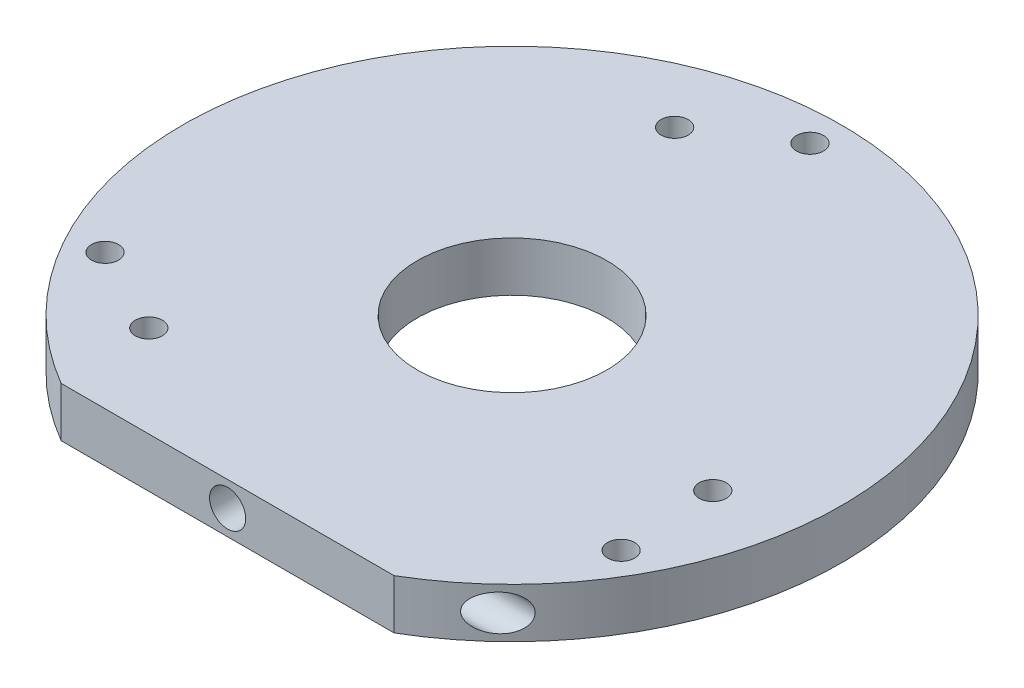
ISO-10303-21;
HEADER;
FILE_DESCRIPTION(('STEP AP214'),'2;1');
FILE_NAME('part.step','',(''),(''),'','','');
FILE_SCHEMA(('AUTOMOTIVE_DESIGN { 1 0 10303 214 1 1 1 1 }'));
ENDSEC;
DATA;
#1=APPLICATION_CONTEXT('core data for automotive mechanical design processes');
#2=APPLICATION_PROTOCOL_DEFINITION('international standard','automotive_design',2000,#1);
#3=PRODUCT_CONTEXT('',#1,'mechanical');
#4=PRODUCT('Part','Part','',(#3));
#5=PRODUCT_RELATED_PRODUCT_CATEGORY('part','',(#4));
#6=PRODUCT_DEFINITION_FORMATION('','',#4);
#7=PRODUCT_DEFINITION_CONTEXT('part definition',#1,'design');
#8=PRODUCT_DEFINITION('design','',#6,#7);
#9=PRODUCT_DEFINITION_SHAPE('','',#8);
#10=(LENGTH_UNIT() NAMED_UNIT(*) SI_UNIT(.MILLI.,.METRE.));
#11=(NAMED_UNIT(*) PLANE_ANGLE_UNIT() SI_UNIT($,.RADIAN.));
#12=(NAMED_UNIT(*) SI_UNIT($,.STERADIAN.) SOLID_ANGLE_UNIT());
#13=UNCERTAINTY_MEASURE_WITH_UNIT(LENGTH_MEASURE(1.E-05),#10,'distance_accuracy_value','');
#14=(GEOMETRIC_REPRESENTATION_CONTEXT(3) GLOBAL_UNCERTAINTY_ASSIGNED_CONTEXT((#13)) GLOBAL_UNIT_ASSIGNED_CONTEXT((#10,
#11,#12)) REPRESENTATION_CONTEXT('',''));
#15=CARTESIAN_POINT('',(0.,0.,0.));
#16=DIRECTION('',(0.,0.,1.));
#17=DIRECTION('',(1.,0.,0.));
#18=AXIS2_PLACEMENT_3D('',#15,#16,#17);
#19=CARTESIAN_POINT('',(36.501,-4.74999999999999,26.5));
#20=DIRECTION('',(-1.,0.,0.));
#21=DIRECTION('',(0.,0.,1.));
#22=AXIS2_PLACEMENT_3D('',#19,#20,#21);
#23=CYLINDRICAL_SURFACE('',#22,2.);
#24=CARTESIAN_POINT('',(22.8035085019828,-4.74999999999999,28.5));
#25=CARTESIAN_POINT('',(22.8035194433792,-4.66614474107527,28.4999917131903));
#26=CARTESIAN_POINT('',(22.8101869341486,-4.58214146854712,28.4946603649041));
#27=CARTESIAN_POINT('',(22.836100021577,-4.41730327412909,28.4738966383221));
#28=CARTESIAN_POINT('',(22.8553814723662,-4.33647808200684,28.4584354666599));
#29=CARTESIAN_POINT('',(22.9042916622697,-4.1812608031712,28.4190848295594));
#30=CARTESIAN_POINT('',(22.9338120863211,-4.10681116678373,28.3952835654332));
#31=CARTESIAN_POINT('',(23.0010219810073,-3.96449597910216,28.3408690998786));
#32=CARTESIAN_POINT('',(23.0387126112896,-3.89663136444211,28.3102549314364));
#33=CARTESIAN_POINT('',(23.1425383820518,-3.73255945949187,28.2255110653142));
#34=CARTESIAN_POINT('',(23.2129906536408,-3.64102699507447,28.1676508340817));
#35=CARTESIAN_POINT('',(23.3634974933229,-3.47316212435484,28.0429420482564));
#36=CARTESIAN_POINT('',(23.443578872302,-3.3968738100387,27.9760683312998));
#37=CARTESIAN_POINT('',(23.5892914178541,-3.27545746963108,27.8532234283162));
#38=CARTESIAN_POINT('',(23.6536059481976,-3.22728716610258,27.798639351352));
#39=CARTESIAN_POINT('',(23.784763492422,-3.13837657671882,27.6865037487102));
#40=CARTESIAN_POINT('',(23.8516077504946,-3.09764000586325,27.6289507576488));
#41=CARTESIAN_POINT('',(24.0548205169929,-2.98595285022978,27.4526435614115));
#42=CARTESIAN_POINT('',(24.1938826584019,-2.92551392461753,27.3302296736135));
#43=CARTESIAN_POINT('',(24.4802446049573,-2.82909849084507,27.0740844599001));
#44=CARTESIAN_POINT('',(24.627655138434,-2.79415684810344,26.9400986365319));
#45=CARTESIAN_POINT('',(24.9223768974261,-2.75228770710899,26.6676836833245));
#46=CARTESIAN_POINT('',(25.0696881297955,-2.74535802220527,26.5292549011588));
#47=CARTESIAN_POINT('',(25.3613275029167,-2.76070477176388,26.2505960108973));
#48=CARTESIAN_POINT('',(25.5056535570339,-2.78300097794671,26.1103647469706));
#49=CARTESIAN_POINT('',(25.7877267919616,-2.85940936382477,25.8318062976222));
#50=CARTESIAN_POINT('',(25.9254811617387,-2.91348587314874,25.6934771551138));
#51=CARTESIAN_POINT('',(26.1515970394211,-3.03641799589,25.462956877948));
#52=CARTESIAN_POINT('',(26.2427926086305,-3.09658550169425,25.3689125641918));
#53=CARTESIAN_POINT('',(26.4167638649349,-3.23641911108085,25.1877003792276));
#54=CARTESIAN_POINT('',(26.4995516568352,-3.31605660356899,25.1005226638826));
#55=CARTESIAN_POINT('',(26.6355340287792,-3.47522142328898,24.9560782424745));
#56=CARTESIAN_POINT('',(26.6911622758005,-3.55059027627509,24.8965356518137));
#57=CARTESIAN_POINT('',(26.7931403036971,-3.71346703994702,24.7867550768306));
#58=CARTESIAN_POINT('',(26.8395013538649,-3.80095998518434,24.7365057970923));
#59=CARTESIAN_POINT('',(26.9134018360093,-3.9708233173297,24.656059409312));
#60=CARTESIAN_POINT('',(26.9428120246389,-4.05144151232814,24.6238951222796));
#61=CARTESIAN_POINT('',(26.9921293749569,-4.21882955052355,24.5698249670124));
#62=CARTESIAN_POINT('',(27.0120416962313,-4.30559602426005,24.5479135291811));
#63=CARTESIAN_POINT('',(27.0412231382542,-4.48350719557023,24.5157651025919));
#64=CARTESIAN_POINT('',(27.0504384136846,-4.57467165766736,24.5055871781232));
#65=CARTESIAN_POINT('',(27.057386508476,-4.75796714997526,24.4979155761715));
#66=CARTESIAN_POINT('',(27.055122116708,-4.85009793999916,24.5004188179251));
#67=CARTESIAN_POINT('',(27.0399634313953,-5.02443145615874,24.5171466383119));
#68=CARTESIAN_POINT('',(27.0279828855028,-5.10681559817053,24.5303636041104));
#69=CARTESIAN_POINT('',(26.9952458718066,-5.26761622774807,24.5663853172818));
#70=CARTESIAN_POINT('',(26.9744886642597,-5.34603238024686,24.5891908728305));
#71=CARTESIAN_POINT('',(26.9241028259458,-5.50074948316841,24.6443529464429));
#72=CARTESIAN_POINT('',(26.8941150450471,-5.57679386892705,24.6770951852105));
#73=CARTESIAN_POINT('',(26.8269802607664,-5.72176054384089,24.7500625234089));
#74=CARTESIAN_POINT('',(26.7898292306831,-5.79067879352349,24.7902918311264));
#75=CARTESIAN_POINT('',(26.6904944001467,-5.95192247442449,24.8972894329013));
#76=CARTESIAN_POINT('',(26.6248128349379,-6.03977326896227,24.9675749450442));
#77=CARTESIAN_POINT('',(26.483957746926,-6.1988282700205,25.116938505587));
#78=CARTESIAN_POINT('',(26.4087637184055,-6.26999553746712,25.1960355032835));
#79=CARTESIAN_POINT('',(26.2230230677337,-6.41932603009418,25.3895022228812));
#80=CARTESIAN_POINT('',(26.1095309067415,-6.49069954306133,25.5062773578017));
#81=CARTESIAN_POINT('',(25.8744931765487,-6.60664263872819,25.7446859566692));
#82=CARTESIAN_POINT('',(25.7529376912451,-6.65117851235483,25.8663253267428));
#83=CARTESIAN_POINT('',(25.4683772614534,-6.72538219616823,26.1469362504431));
#84=CARTESIAN_POINT('',(25.3036716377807,-6.74685849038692,26.3063937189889));
#85=CARTESIAN_POINT('',(25.054260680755,-6.75109382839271,26.5433116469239));
#86=CARTESIAN_POINT('',(24.9706118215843,-6.74781793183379,26.6220157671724));
#87=CARTESIAN_POINT('',(24.8030436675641,-6.73210996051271,26.7782016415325));
#88=CARTESIAN_POINT('',(24.7191245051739,-6.71968184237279,26.8556839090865));
#89=CARTESIAN_POINT('',(24.5506433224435,-6.68556392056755,27.0097965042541));
#90=CARTESIAN_POINT('',(24.4660845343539,-6.66377263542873,27.0864077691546));
#91=CARTESIAN_POINT('',(24.2978650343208,-6.61081415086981,27.2374104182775));
#92=CARTESIAN_POINT('',(24.2142045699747,-6.57964443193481,27.3118012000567));
#93=CARTESIAN_POINT('',(24.0487721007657,-6.50773501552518,27.4575796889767));
#94=CARTESIAN_POINT('',(23.9669959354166,-6.46701918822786,27.5289743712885));
#95=CARTESIAN_POINT('',(23.8061573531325,-6.37551184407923,27.6681797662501));
#96=CARTESIAN_POINT('',(23.7270928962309,-6.32472810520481,27.7359931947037));
#97=CARTESIAN_POINT('',(23.5660096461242,-6.20728499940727,27.8730216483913));
#98=CARTESIAN_POINT('',(23.4843634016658,-6.13960936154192,27.9418154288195));
#99=CARTESIAN_POINT('',(23.3284027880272,-5.99021576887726,28.0721553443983));
#100=CARTESIAN_POINT('',(23.2540791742,-5.90851588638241,28.1337106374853));
#101=CARTESIAN_POINT('',(23.1324306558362,-5.7503510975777,28.2337631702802));
#102=CARTESIAN_POINT('',(23.0828195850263,-5.67696692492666,28.2743134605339));
#103=CARTESIAN_POINT('',(22.9929649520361,-5.52096081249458,28.3474321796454));
#104=CARTESIAN_POINT('',(22.9527095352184,-5.43835076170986,28.3800107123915));
#105=CARTESIAN_POINT('',(22.8923772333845,-5.28403428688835,28.4286867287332));
#106=CARTESIAN_POINT('',(22.8698066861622,-5.21395637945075,28.4468356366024));
#107=CARTESIAN_POINT('',(22.8340060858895,-5.07003923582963,28.4755808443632));
#108=CARTESIAN_POINT('',(22.8207512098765,-4.99621056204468,28.4861972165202));
#109=CARTESIAN_POINT('',(22.8096595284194,-4.89312844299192,28.4950775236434));
#110=CARTESIAN_POINT('',(22.807358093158,-4.86459020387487,28.4969195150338));
#111=CARTESIAN_POINT('',(22.8042805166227,-4.80737377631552,28.4993823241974));
#112=CARTESIAN_POINT('',(22.8035047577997,-4.77869555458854,28.5000028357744));
#113=CARTESIAN_POINT('',(22.8035085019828,-4.74999999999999,28.5));
#114=B_SPLINE_CURVE_WITH_KNOTS('',3,(#24,#25,#26,#27,#28,#29,#30,#31,#32,#33,#34,#35,#36,#37,
#38,#39,#40,#41,#42,#43,#44,#45,#46,#47,#48,#49,#50,#51,#52,#53,#54,#55,#56,#57,#58,#59,#60,#61,
#62,#63,#64,#65,#66,#67,#68,#69,#70,#71,#72,#73,#74,#75,#76,#77,#78,#79,#80,#81,#82,#83,#84,#85,
#86,#87,#88,#89,#90,#91,#92,#93,#94,#95,#96,#97,#98,#99,#100,#101,#102,#103,#104,#105,#106,#107,
#108,#109,#110,#111,#112,#113),.UNSPECIFIED.,.T.,.F.,(4,2,2,2,2,2,2,2,2,2,2,2,2,2,2,2,2,2,2,2,2,
2,2,2,2,2,2,2,2,2,2,2,2,2,2,2,2,2,2,2,2,2,2,2,4),(0.,0.251419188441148,0.503556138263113,
0.753103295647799,1.0026858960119,1.3880944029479,1.77460201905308,2.06563988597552,
2.35682280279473,2.93912672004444,3.54391885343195,4.14866377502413,4.75381802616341,
5.35829434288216,5.78938786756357,6.21985166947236,6.55165131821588,6.88304499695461,
7.15684714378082,7.43050038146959,7.7055252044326,7.98048321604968,8.23222343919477,
8.48398488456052,8.74714645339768,9.01045638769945,9.39910954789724,9.78861526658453,
10.3190888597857,10.850227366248,11.537142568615,11.881574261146,12.2258571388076,
12.573969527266,12.922175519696,13.2695199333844,13.6165970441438,13.9948499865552,
14.3726191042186,14.6639364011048,14.9548825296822,15.1814902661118,15.4074918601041,
15.4935068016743,15.5795433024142),.UNSPECIFIED.);
#115=CARTESIAN_POINT('',(22.8035085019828,-4.74999999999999,28.5));
#116=VERTEX_POINT('',#115);
#117=EDGE_CURVE('E103',#116,#116,#114,.T.);
#118=ORIENTED_EDGE('',*,*,#117,.F.);
#119=EDGE_LOOP('',(#118));
#120=FACE_BOUND('',#119,.T.);
#121=CARTESIAN_POINT('',(0.000911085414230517,-4.75,26.5));
#122=DIRECTION('',(-0.707106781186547,0.,-0.707106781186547));
#123=DIRECTION('',(-0.707106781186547,0.,0.707106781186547));
#124=AXIS2_PLACEMENT_3D('',#121,#122,#123);
#125=ELLIPSE('',#124,2.82842712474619,2.);
#126=CARTESIAN_POINT('',(0.000911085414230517,-2.75,26.5));
#127=VERTEX_POINT('',#126);
#128=CARTESIAN_POINT('',(0.000911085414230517,-6.75,26.5));
#129=VERTEX_POINT('',#128);
#130=EDGE_CURVE('E98',#127,#129,#125,.T.);
#131=ORIENTED_EDGE('',*,*,#130,.T.);
#132=CARTESIAN_POINT('',(0.000911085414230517,-4.75,26.5));
#133=DIRECTION('',(-0.707106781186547,0.,0.707106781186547));
#134=DIRECTION('',(-0.707106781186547,0.,-0.707106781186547));
#135=AXIS2_PLACEMENT_3D('',#132,#133,#134);
#136=ELLIPSE('',#135,2.82842712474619,2.);
#137=EDGE_CURVE('E96',#129,#127,#136,.T.);
#138=ORIENTED_EDGE('',*,*,#137,.T.);
#139=EDGE_LOOP('',(#131,#138));
#140=FACE_BOUND('',#139,.T.);
#141=ADVANCED_FACE('F44',(#120,#140),#23,.F.);
#142=CARTESIAN_POINT('',(0.,37.9568335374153,0.));
#143=DIRECTION('',(0.,1.,0.));
#144=DIRECTION('',(0.,0.,1.));
#145=AXIS2_PLACEMENT_3D('',#142,#143,#144);
#146=CYLINDRICAL_SURFACE('',#145,36.5);
#147=CARTESIAN_POINT('',(0.,-1.99999999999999,0.));
#148=DIRECTION('',(0.,1.,0.));
#149=DIRECTION('',(0.,0.,1.));
#150=AXIS2_PLACEMENT_3D('',#147,#148,#149);
#151=CIRCLE('',#150,36.5);
#152=CARTESIAN_POINT('',(18.4390889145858,-1.99999999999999,31.5));
#153=VERTEX_POINT('',#152);
#154=CARTESIAN_POINT('',(-18.4390889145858,-1.99999999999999,31.5));
#155=VERTEX_POINT('',#154);
#156=EDGE_CURVE('E250',#153,#155,#151,.T.);
#157=ORIENTED_EDGE('',*,*,#156,.F.);
#158=DIRECTION('',(0.,1.,0.));
#159=VECTOR('',#158,1.);
#160=CARTESIAN_POINT('',(18.4390889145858,37.9568335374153,31.5));
#161=LINE('',#160,#159);
#162=CARTESIAN_POINT('',(18.4390889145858,-7.5,31.5));
#163=VERTEX_POINT('',#162);
#164=EDGE_CURVE('E99',#153,#163,#161,.F.);
#165=ORIENTED_EDGE('',*,*,#164,.T.);
#166=CARTESIAN_POINT('',(0.,-7.5,0.));
#167=DIRECTION('',(0.,1.,0.));
#168=DIRECTION('',(0.,0.,1.));
#169=AXIS2_PLACEMENT_3D('',#166,#167,#168);
#170=CIRCLE('',#169,36.5);
#171=CARTESIAN_POINT('',(-18.4390889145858,-7.5,31.5));
#172=VERTEX_POINT('',#171);
#173=EDGE_CURVE('E255',#163,#172,#170,.T.);
#174=ORIENTED_EDGE('',*,*,#173,.T.);
#175=DIRECTION('',(0.,1.,0.));
#176=VECTOR('',#175,1.);
#177=CARTESIAN_POINT('',(-18.4390889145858,37.9568335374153,31.5));
#178=LINE('',#177,#176);
#179=EDGE_CURVE('E272',#172,#155,#178,.T.);
#180=ORIENTED_EDGE('',*,*,#179,.T.);
#181=EDGE_LOOP('',(#157,#165,#174,#180));
#182=FACE_BOUND('',#181,.T.);
#183=ORIENTED_EDGE('',*,*,#117,.T.);
#184=EDGE_LOOP('',(#183));
#185=FACE_BOUND('',#184,.T.);
#186=ADVANCED_FACE('F145',(#182,#185),#146,.T.);
#187=CARTESIAN_POINT('',(36.5,-2.,0.));
#188=DIRECTION('',(0.,-1.,0.));
#189=DIRECTION('',(0.,0.,-1.));
#190=AXIS2_PLACEMENT_3D('',#187,#188,#189);
#191=PLANE('',#190);
#192=CARTESIAN_POINT('',(-18.8964289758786,-2.,21.3348300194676));
#193=DIRECTION('',(0.,1.,0.));
#194=DIRECTION('',(0.,0.,1.));
#195=AXIS2_PLACEMENT_3D('',#192,#193,#194);
#196=CIRCLE('',#195,1.5);
#197=CARTESIAN_POINT('',(-18.8964289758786,-2.,22.8348300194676));
#198=VERTEX_POINT('',#197);
#199=EDGE_CURVE('E204',#198,#198,#196,.T.);
#200=ORIENTED_EDGE('',*,*,#199,.F.);
#201=EDGE_LOOP('',(#200));
#202=FACE_BOUND('',#201,.T.);
#203=CARTESIAN_POINT('',(-9.02829029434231,-2.,-27.0322025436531));
#204=DIRECTION('',(0.,1.,0.));
#205=DIRECTION('',(0.,0.,1.));
#206=AXIS2_PLACEMENT_3D('',#203,#204,#205);
#207=CIRCLE('',#206,1.5);
#208=CARTESIAN_POINT('',(-9.02829029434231,-2.,-25.5322025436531));
#209=VERTEX_POINT('',#208);
#210=EDGE_CURVE('E216',#209,#209,#207,.T.);
#211=ORIENTED_EDGE('',*,*,#210,.F.);
#212=EDGE_LOOP('',(#211));
#213=FACE_BOUND('',#212,.T.);
#214=CARTESIAN_POINT('',(27.924719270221,-2.,5.69737252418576));
#215=DIRECTION('',(0.,1.,0.));
#216=DIRECTION('',(0.,0.,1.));
#217=AXIS2_PLACEMENT_3D('',#214,#215,#216);
#218=CIRCLE('',#217,1.5);
#219=CARTESIAN_POINT('',(27.924719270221,-2.,7.19737252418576));
#220=VERTEX_POINT('',#219);
#221=EDGE_CURVE('E224',#220,#220,#218,.T.);
#222=ORIENTED_EDGE('',*,*,#221,.F.);
#223=EDGE_LOOP('',(#222));
#224=FACE_BOUND('',#223,.T.);
#225=CARTESIAN_POINT('',(0.,-2.,-33.));
#226=DIRECTION('',(0.,-1.,0.));
#227=DIRECTION('',(0.,0.,-1.));
#228=AXIS2_PLACEMENT_3D('',#225,#226,#227);
#229=CIRCLE('',#228,1.5);
#230=CARTESIAN_POINT('',(0.,-2.,-34.5));
#231=VERTEX_POINT('',#230);
#232=EDGE_CURVE('E234',#231,#231,#229,.T.);
#233=ORIENTED_EDGE('',*,*,#232,.T.);
#234=EDGE_LOOP('',(#233));
#235=FACE_BOUND('',#234,.T.);
#236=CARTESIAN_POINT('',(28.578838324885,-2.,16.5000000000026));
#237=DIRECTION('',(0.,-1.,0.));
#238=DIRECTION('',(0.,0.,-1.));
#239=AXIS2_PLACEMENT_3D('',#236,#237,#238);
#240=CIRCLE('',#239,1.49999999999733);
#241=CARTESIAN_POINT('',(28.578838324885,-2.,15.0000000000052));
#242=VERTEX_POINT('',#241);
#243=EDGE_CURVE('E238',#242,#242,#240,.T.);
#244=ORIENTED_EDGE('',*,*,#243,.T.);
#245=EDGE_LOOP('',(#244));
#246=FACE_BOUND('',#245,.T.);
#247=CARTESIAN_POINT('',(-28.5788383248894,-2.,16.4999999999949));
#248=DIRECTION('',(0.,-1.,0.));
#249=DIRECTION('',(0.,0.,-1.));
#250=AXIS2_PLACEMENT_3D('',#247,#248,#249);
#251=CIRCLE('',#250,1.49999999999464);
#252=CARTESIAN_POINT('',(-28.5788383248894,-2.,15.0000000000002));
#253=VERTEX_POINT('',#252);
#254=EDGE_CURVE('E242',#253,#253,#251,.T.);
#255=ORIENTED_EDGE('',*,*,#254,.T.);
#256=EDGE_LOOP('',(#255));
#257=FACE_BOUND('',#256,.T.);
#258=CARTESIAN_POINT('',(0.,-2.,0.));
#259=DIRECTION('',(0.,1.,0.));
#260=DIRECTION('',(0.,0.,1.));
#261=AXIS2_PLACEMENT_3D('',#258,#259,#260);
#262=CIRCLE('',#261,10.5);
#263=CARTESIAN_POINT('',(0.,-2.,10.5));
#264=VERTEX_POINT('',#263);
#265=EDGE_CURVE('E246',#264,#264,#262,.T.);
#266=ORIENTED_EDGE('',*,*,#265,.F.);
#267=EDGE_LOOP('',(#266));
#268=FACE_BOUND('',#267,.T.);
#269=ORIENTED_EDGE('',*,*,#156,.T.);
#270=DIRECTION('',(1.,0.,0.));
#271=VECTOR('',#270,1.);
#272=CARTESIAN_POINT('',(36.5,-2.,31.5));
#273=LINE('',#272,#271);
#274=EDGE_CURVE('E251',#155,#153,#273,.T.);
#275=ORIENTED_EDGE('',*,*,#274,.T.);
#276=EDGE_LOOP('',(#269,#275));
#277=FACE_BOUND('',#276,.T.);
#278=ADVANCED_FACE('F46',(#202,#213,#224,#235,#246,#257,#268,#277),#191,.F.);
#279=CARTESIAN_POINT('',(0.,37.9568335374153,0.));
#280=DIRECTION('',(0.,1.,0.));
#281=DIRECTION('',(0.,0.,1.));
#282=AXIS2_PLACEMENT_3D('',#279,#280,#281);
#283=CYLINDRICAL_SURFACE('',#282,10.5);
#284=CARTESIAN_POINT('',(0.,-7.5,0.));
#285=DIRECTION('',(0.,1.,0.));
#286=DIRECTION('',(0.,0.,1.));
#287=AXIS2_PLACEMENT_3D('',#284,#285,#286);
#288=CIRCLE('',#287,10.5);
#289=CARTESIAN_POINT('',(0.,-7.5,10.5));
#290=VERTEX_POINT('',#289);
#291=EDGE_CURVE('E261',#290,#290,#288,.T.);
#292=ORIENTED_EDGE('',*,*,#291,.F.);
#293=EDGE_LOOP('',(#292));
#294=FACE_BOUND('',#293,.T.);
#295=ORIENTED_EDGE('',*,*,#265,.T.);
#296=EDGE_LOOP('',(#295));
#297=FACE_BOUND('',#296,.T.);
#298=ADVANCED_FACE('F150',(#294,#297),#283,.F.);
#299=CARTESIAN_POINT('',(36.5,-7.5,0.));
#300=DIRECTION('',(0.,1.,0.));
#301=DIRECTION('',(0.,0.,1.));
#302=AXIS2_PLACEMENT_3D('',#299,#300,#301);
#303=PLANE('',#302);
#304=CARTESIAN_POINT('',(-18.8964289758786,-7.5,21.3348300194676));
#305=DIRECTION('',(0.,1.,0.));
#306=DIRECTION('',(0.,0.,1.));
#307=AXIS2_PLACEMENT_3D('',#304,#305,#306);
#308=CIRCLE('',#307,1.5);
#309=CARTESIAN_POINT('',(-18.8964289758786,-7.5,22.8348300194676));
#310=VERTEX_POINT('',#309);
#311=EDGE_CURVE('E199',#310,#310,#308,.T.);
#312=ORIENTED_EDGE('',*,*,#311,.T.);
#313=EDGE_LOOP('',(#312));
#314=FACE_BOUND('',#313,.T.);
#315=CARTESIAN_POINT('',(-9.02829029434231,-7.5,-27.0322025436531));
#316=DIRECTION('',(0.,1.,0.));
#317=DIRECTION('',(0.,0.,1.));
#318=AXIS2_PLACEMENT_3D('',#315,#316,#317);
#319=CIRCLE('',#318,1.5);
#320=CARTESIAN_POINT('',(-9.02829029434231,-7.5,-25.5322025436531));
#321=VERTEX_POINT('',#320);
#322=EDGE_CURVE('E210',#321,#321,#319,.T.);
#323=ORIENTED_EDGE('',*,*,#322,.T.);
#324=EDGE_LOOP('',(#323));
#325=FACE_BOUND('',#324,.T.);
#326=CARTESIAN_POINT('',(27.924719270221,-7.5,5.69737252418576));
#327=DIRECTION('',(0.,1.,0.));
#328=DIRECTION('',(0.,0.,1.));
#329=AXIS2_PLACEMENT_3D('',#326,#327,#328);
#330=CIRCLE('',#329,1.5);
#331=CARTESIAN_POINT('',(27.924719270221,-7.5,7.19737252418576));
#332=VERTEX_POINT('',#331);
#333=EDGE_CURVE('E220',#332,#332,#330,.T.);
#334=ORIENTED_EDGE('',*,*,#333,.T.);
#335=EDGE_LOOP('',(#334));
#336=FACE_BOUND('',#335,.T.);
#337=CARTESIAN_POINT('',(0.,-7.5,-33.));
#338=DIRECTION('',(0.,1.,0.));
#339=DIRECTION('',(0.,0.,1.));
#340=AXIS2_PLACEMENT_3D('',#337,#338,#339);
#341=CIRCLE('',#340,1.5);
#342=CARTESIAN_POINT('',(0.,-7.5,-31.5));
#343=VERTEX_POINT('',#342);
#344=EDGE_CURVE('E121',#343,#343,#341,.T.);
#345=ORIENTED_EDGE('',*,*,#344,.T.);
#346=EDGE_LOOP('',(#345));
#347=FACE_BOUND('',#346,.T.);
#348=CARTESIAN_POINT('',(28.578838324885,-7.5,16.5000000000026));
#349=DIRECTION('',(0.,1.,0.));
#350=DIRECTION('',(0.,0.,1.));
#351=AXIS2_PLACEMENT_3D('',#348,#349,#350);
#352=CIRCLE('',#351,1.49999999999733);
#353=CARTESIAN_POINT('',(28.578838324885,-7.5,17.9999999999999));
#354=VERTEX_POINT('',#353);
#355=EDGE_CURVE('E310',#354,#354,#352,.T.);
#356=ORIENTED_EDGE('',*,*,#355,.T.);
#357=EDGE_LOOP('',(#356));
#358=FACE_BOUND('',#357,.T.);
#359=CARTESIAN_POINT('',(-28.5788383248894,-7.5,16.4999999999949));
#360=DIRECTION('',(0.,1.,0.));
#361=DIRECTION('',(0.,0.,1.));
#362=AXIS2_PLACEMENT_3D('',#359,#360,#361);
#363=CIRCLE('',#362,1.49999999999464);
#364=CARTESIAN_POINT('',(-28.5788383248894,-7.5,17.9999999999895));
#365=VERTEX_POINT('',#364);
#366=EDGE_CURVE('E108',#365,#365,#363,.T.);
#367=ORIENTED_EDGE('',*,*,#366,.T.);
#368=EDGE_LOOP('',(#367));
#369=FACE_BOUND('',#368,.T.);
#370=ORIENTED_EDGE('',*,*,#173,.F.);
#371=DIRECTION('',(-1.,0.,0.));
#372=VECTOR('',#371,1.);
#373=CARTESIAN_POINT('',(36.5,-7.5,31.5));
#374=LINE('',#373,#372);
#375=EDGE_CURVE('E263',#163,#172,#374,.T.);
#376=ORIENTED_EDGE('',*,*,#375,.T.);
#377=EDGE_LOOP('',(#370,#376));
#378=FACE_BOUND('',#377,.T.);
#379=ORIENTED_EDGE('',*,*,#291,.T.);
#380=EDGE_LOOP('',(#379));
#381=FACE_BOUND('',#380,.T.);
#382=ADVANCED_FACE('F143',(#314,#325,#336,#347,#358,#369,#378,#381),#303,.F.);
#383=CARTESIAN_POINT('',(-18.4390889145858,-8.,31.5));
#384=DIRECTION('',(0.,0.,-1.));
#385=DIRECTION('',(-1.,0.,0.));
#386=AXIS2_PLACEMENT_3D('',#383,#384,#385);
#387=PLANE('',#386);
#388=CARTESIAN_POINT('',(0.000911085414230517,-4.75,31.5));
#389=DIRECTION('',(0.,0.,-1.));
#390=DIRECTION('',(-1.,0.,0.));
#391=AXIS2_PLACEMENT_3D('',#388,#389,#390);
#392=CIRCLE('',#391,2.);
#393=CARTESIAN_POINT('',(-1.99908891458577,-4.75,31.5));
#394=VERTEX_POINT('',#393);
#395=EDGE_CURVE('E113',#394,#394,#392,.T.);
#396=ORIENTED_EDGE('',*,*,#395,.T.);
#397=EDGE_LOOP('',(#396));
#398=FACE_BOUND('',#397,.T.);
#399=ORIENTED_EDGE('',*,*,#179,.F.);
#400=ORIENTED_EDGE('',*,*,#375,.F.);
#401=ORIENTED_EDGE('',*,*,#164,.F.);
#402=ORIENTED_EDGE('',*,*,#274,.F.);
#403=EDGE_LOOP('',(#399,#400,#401,#402));
#404=FACE_BOUND('',#403,.T.);
#405=ADVANCED_FACE('F139',(#398,#404),#387,.F.);
#406=CARTESIAN_POINT('',(-28.5788383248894,-7.5,16.4999999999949));
#407=DIRECTION('',(0.,1.,0.));
#408=DIRECTION('',(0.,0.,1.));
#409=AXIS2_PLACEMENT_3D('',#406,#407,#408);
#410=CYLINDRICAL_SURFACE('',#409,1.49999999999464);
#411=ORIENTED_EDGE('',*,*,#366,.F.);
#412=EDGE_LOOP('',(#411));
#413=FACE_BOUND('',#412,.T.);
#414=ORIENTED_EDGE('',*,*,#254,.F.);
#415=EDGE_LOOP('',(#414));
#416=FACE_BOUND('',#415,.T.);
#417=ADVANCED_FACE('F135',(#413,#416),#410,.F.);
#418=CARTESIAN_POINT('',(28.578838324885,-7.5,16.5000000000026));
#419=DIRECTION('',(0.,1.,0.));
#420=DIRECTION('',(0.,0.,1.));
#421=AXIS2_PLACEMENT_3D('',#418,#419,#420);
#422=CYLINDRICAL_SURFACE('',#421,1.49999999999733);
#423=ORIENTED_EDGE('',*,*,#355,.F.);
#424=EDGE_LOOP('',(#423));
#425=FACE_BOUND('',#424,.T.);
#426=ORIENTED_EDGE('',*,*,#243,.F.);
#427=EDGE_LOOP('',(#426));
#428=FACE_BOUND('',#427,.T.);
#429=ADVANCED_FACE('F131',(#425,#428),#422,.F.);
#430=CARTESIAN_POINT('',(0.,-7.5,-33.));
#431=DIRECTION('',(0.,1.,0.));
#432=DIRECTION('',(0.,0.,1.));
#433=AXIS2_PLACEMENT_3D('',#430,#431,#432);
#434=CYLINDRICAL_SURFACE('',#433,1.5);
#435=ORIENTED_EDGE('',*,*,#344,.F.);
#436=EDGE_LOOP('',(#435));
#437=FACE_BOUND('',#436,.T.);
#438=ORIENTED_EDGE('',*,*,#232,.F.);
#439=EDGE_LOOP('',(#438));
#440=FACE_BOUND('',#439,.T.);
#441=ADVANCED_FACE('F128',(#437,#440),#434,.F.);
#442=CARTESIAN_POINT('',(0.000911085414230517,-4.75,21.5));
#443=DIRECTION('',(0.,0.,1.));
#444=DIRECTION('',(1.,0.,0.));
#445=AXIS2_PLACEMENT_3D('',#442,#443,#444);
#446=CYLINDRICAL_SURFACE('',#445,2.);
#447=CARTESIAN_POINT('',(0.000911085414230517,-4.75,21.5));
#448=DIRECTION('',(0.,0.,-1.));
#449=DIRECTION('',(-1.,0.,0.));
#450=AXIS2_PLACEMENT_3D('',#447,#448,#449);
#451=CIRCLE('',#450,2.);
#452=CARTESIAN_POINT('',(-1.99908891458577,-4.75,21.5));
#453=VERTEX_POINT('',#452);
#454=EDGE_CURVE('E110',#453,#453,#451,.T.);
#455=ORIENTED_EDGE('',*,*,#454,.T.);
#456=EDGE_LOOP('',(#455));
#457=FACE_BOUND('',#456,.T.);
#458=ORIENTED_EDGE('',*,*,#395,.F.);
#459=EDGE_LOOP('',(#458));
#460=FACE_BOUND('',#459,.T.);
#461=CARTESIAN_POINT('',(0.,-4.74999999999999,26.5));
#462=DIRECTION('',(1.,0.,0.));
#463=DIRECTION('',(0.,0.,-1.));
#464=AXIS2_PLACEMENT_3D('',#461,#462,#463);
#465=CIRCLE('',#464,2.);
#466=CARTESIAN_POINT('',(0.,-6.74999979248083,26.5009110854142));
#467=VERTEX_POINT('',#466);
#468=CARTESIAN_POINT('',(0.,-6.74999979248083,26.4990889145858));
#469=VERTEX_POINT('',#468);
#470=EDGE_CURVE('E94',#467,#469,#465,.T.);
#471=ORIENTED_EDGE('',*,*,#470,.T.);
#472=CARTESIAN_POINT('',(0.000911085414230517,-4.75,26.5));
#473=DIRECTION('',(-0.707106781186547,0.,0.707106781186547));
#474=DIRECTION('',(-0.707106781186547,0.,-0.707106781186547));
#475=AXIS2_PLACEMENT_3D('',#472,#473,#474);
#476=ELLIPSE('',#475,2.82842712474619,2.);
#477=EDGE_CURVE('E48',#129,#469,#476,.F.);
#478=ORIENTED_EDGE('',*,*,#477,.F.);
#479=ORIENTED_EDGE('',*,*,#130,.F.);
#480=CARTESIAN_POINT('',(0.,-2.75000020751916,26.4990889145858));
#481=VERTEX_POINT('',#480);
#482=EDGE_CURVE('E11',#481,#127,#476,.F.);
#483=ORIENTED_EDGE('',*,*,#482,.F.);
#484=CARTESIAN_POINT('',(0.,-2.75000020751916,26.5009110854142));
#485=VERTEX_POINT('',#484);
#486=EDGE_CURVE('E69',#481,#485,#465,.T.);
#487=ORIENTED_EDGE('',*,*,#486,.T.);
#488=CARTESIAN_POINT('',(0.000911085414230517,-4.75,26.5));
#489=DIRECTION('',(-0.707106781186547,0.,-0.707106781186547));
#490=DIRECTION('',(-0.707106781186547,0.,0.707106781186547));
#491=AXIS2_PLACEMENT_3D('',#488,#489,#490);
#492=ELLIPSE('',#491,2.82842712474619,2.);
#493=EDGE_CURVE('E54',#127,#485,#492,.F.);
#494=ORIENTED_EDGE('',*,*,#493,.F.);
#495=ORIENTED_EDGE('',*,*,#137,.F.);
#496=EDGE_CURVE('E61',#467,#129,#492,.F.);
#497=ORIENTED_EDGE('',*,*,#496,.F.);
#498=EDGE_LOOP('',(#471,#478,#479,#483,#487,#494,#495,#497));
#499=FACE_BOUND('',#498,.T.);
#500=ADVANCED_FACE('F92',(#457,#460,#499),#446,.F.);
#501=CARTESIAN_POINT('',(0.000911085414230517,-4.75,21.5));
#502=DIRECTION('',(0.,0.,-1.));
#503=DIRECTION('',(-1.,0.,0.));
#504=AXIS2_PLACEMENT_3D('',#501,#502,#503);
#505=PLANE('',#504);
#506=ORIENTED_EDGE('',*,*,#454,.F.);
#507=EDGE_LOOP('',(#506));
#508=FACE_BOUND('',#507,.T.);
#509=ADVANCED_FACE('F167',(#508),#505,.F.);
#510=ORIENTED_EDGE('',*,*,#486,.F.);
#511=ORIENTED_EDGE('',*,*,#482,.T.);
#512=ORIENTED_EDGE('',*,*,#493,.T.);
#513=EDGE_LOOP('',(#510,#511,#512));
#514=FACE_BOUND('',#513,.T.);
#515=ADVANCED_FACE('F123',(#514),#23,.F.);
#516=ORIENTED_EDGE('',*,*,#496,.T.);
#517=ORIENTED_EDGE('',*,*,#477,.T.);
#518=ORIENTED_EDGE('',*,*,#470,.F.);
#519=EDGE_LOOP('',(#516,#517,#518));
#520=FACE_BOUND('',#519,.T.);
#521=ADVANCED_FACE('F101',(#520),#23,.F.);
#522=CARTESIAN_POINT('',(27.924719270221,-7.5,5.69737252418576));
#523=DIRECTION('',(0.,1.,0.));
#524=DIRECTION('',(0.,0.,1.));
#525=AXIS2_PLACEMENT_3D('',#522,#523,#524);
#526=CYLINDRICAL_SURFACE('',#525,1.5);
#527=ORIENTED_EDGE('',*,*,#333,.F.);
#528=EDGE_LOOP('',(#527));
#529=FACE_BOUND('',#528,.T.);
#530=ORIENTED_EDGE('',*,*,#221,.T.);
#531=EDGE_LOOP('',(#530));
#532=FACE_BOUND('',#531,.T.);
#533=ADVANCED_FACE('F170',(#529,#532),#526,.F.);
#534=CARTESIAN_POINT('',(-9.02829029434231,-7.5,-27.0322025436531));
#535=DIRECTION('',(0.,1.,0.));
#536=DIRECTION('',(0.,0.,1.));
#537=AXIS2_PLACEMENT_3D('',#534,#535,#536);
#538=CYLINDRICAL_SURFACE('',#537,1.5);
#539=ORIENTED_EDGE('',*,*,#322,.F.);
#540=EDGE_LOOP('',(#539));
#541=FACE_BOUND('',#540,.T.);
#542=ORIENTED_EDGE('',*,*,#210,.T.);
#543=EDGE_LOOP('',(#542));
#544=FACE_BOUND('',#543,.T.);
#545=ADVANCED_FACE('F174',(#541,#544),#538,.F.);
#546=CARTESIAN_POINT('',(-18.8964289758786,-7.5,21.3348300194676));
#547=DIRECTION('',(0.,1.,0.));
#548=DIRECTION('',(0.,0.,1.));
#549=AXIS2_PLACEMENT_3D('',#546,#547,#548);
#550=CYLINDRICAL_SURFACE('',#549,1.5);
#551=ORIENTED_EDGE('',*,*,#311,.F.);
#552=EDGE_LOOP('',(#551));
#553=FACE_BOUND('',#552,.T.);
#554=ORIENTED_EDGE('',*,*,#199,.T.);
#555=EDGE_LOOP('',(#554));
#556=FACE_BOUND('',#555,.T.);
#557=ADVANCED_FACE('F180',(#553,#556),#550,.F.);
#558=CLOSED_SHELL('',(#141,#186,#278,#298,#382,#405,#417,#429,#441,#500,#509,#515,#521,#533,
#545,#557));
#559=MANIFOLD_SOLID_BREP('B2',#558);
#560=ADVANCED_BREP_SHAPE_REPRESENTATION('',(#18,#559),#14);
#561=SHAPE_DEFINITION_REPRESENTATION(#9,#560);
ENDSEC;
END-ISO-10303-21;
